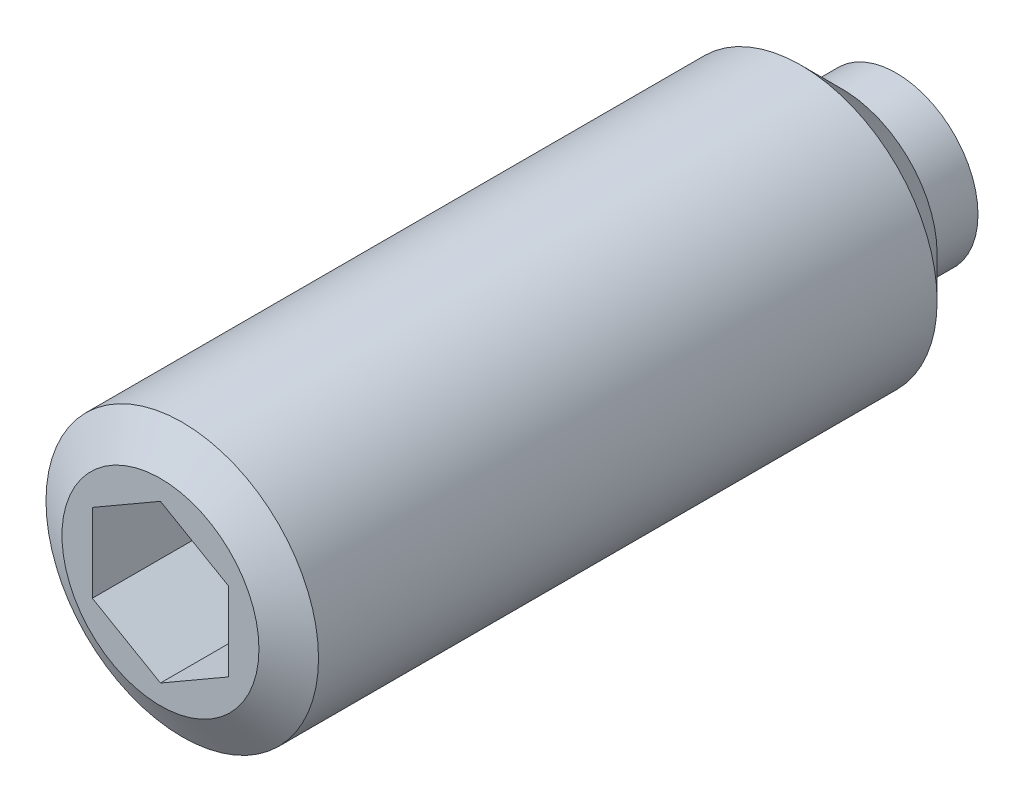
ISO-10303-21;
HEADER;
FILE_DESCRIPTION(('STEP AP214'),'2;1');
FILE_NAME('part.step','',(''),(''),'','','');
FILE_SCHEMA(('AUTOMOTIVE_DESIGN { 1 0 10303 214 1 1 1 1 }'));
ENDSEC;
DATA;
#1=APPLICATION_CONTEXT('core data for automotive mechanical design processes');
#2=APPLICATION_PROTOCOL_DEFINITION('international standard','automotive_design',2000,#1);
#3=PRODUCT_CONTEXT('',#1,'mechanical');
#4=PRODUCT('Part','Part','',(#3));
#5=PRODUCT_RELATED_PRODUCT_CATEGORY('part','',(#4));
#6=PRODUCT_DEFINITION_FORMATION('','',#4);
#7=PRODUCT_DEFINITION_CONTEXT('part definition',#1,'design');
#8=PRODUCT_DEFINITION('design','',#6,#7);
#9=PRODUCT_DEFINITION_SHAPE('','',#8);
#10=(LENGTH_UNIT() NAMED_UNIT(*) SI_UNIT(.MILLI.,.METRE.));
#11=(NAMED_UNIT(*) PLANE_ANGLE_UNIT() SI_UNIT($,.RADIAN.));
#12=(NAMED_UNIT(*) SI_UNIT($,.STERADIAN.) SOLID_ANGLE_UNIT());
#13=UNCERTAINTY_MEASURE_WITH_UNIT(LENGTH_MEASURE(1.E-05),#10,'distance_accuracy_value','');
#14=(GEOMETRIC_REPRESENTATION_CONTEXT(3) GLOBAL_UNCERTAINTY_ASSIGNED_CONTEXT((#13)) GLOBAL_UNIT_ASSIGNED_CONTEXT((#10,
#11,#12)) REPRESENTATION_CONTEXT('',''));
#15=CARTESIAN_POINT('',(0.,0.,0.));
#16=DIRECTION('',(0.,0.,1.));
#17=DIRECTION('',(1.,0.,0.));
#18=AXIS2_PLACEMENT_3D('',#15,#16,#17);
#19=CARTESIAN_POINT('',(3.,0.,0.));
#20=DIRECTION('',(0.,0.,-1.));
#21=DIRECTION('',(-1.,0.,0.));
#22=AXIS2_PLACEMENT_3D('',#19,#20,#21);
#23=PLANE('',#22);
#24=CARTESIAN_POINT('',(0.,0.,0.));
#25=DIRECTION('',(0.,0.,1.));
#26=DIRECTION('',(1.,0.,0.));
#27=AXIS2_PLACEMENT_3D('',#24,#25,#26);
#28=CIRCLE('',#27,3.);
#29=CARTESIAN_POINT('',(3.,0.,0.));
#30=VERTEX_POINT('',#29);
#31=EDGE_CURVE('E124',#30,#30,#28,.T.);
#32=ORIENTED_EDGE('',*,*,#31,.F.);
#33=EDGE_LOOP('',(#32));
#34=FACE_BOUND('',#33,.T.);
#35=ADVANCED_FACE('F14',(#34),#23,.T.);
#36=CARTESIAN_POINT('',(0.,0.,47.));
#37=DIRECTION('',(0.,0.,1.));
#38=DIRECTION('',(1.,0.,0.));
#39=AXIS2_PLACEMENT_3D('',#36,#37,#38);
#40=CYLINDRICAL_SURFACE('',#39,3.);
#41=CARTESIAN_POINT('',(0.,0.,2.));
#42=DIRECTION('',(0.,0.,1.));
#43=DIRECTION('',(1.,0.,0.));
#44=AXIS2_PLACEMENT_3D('',#41,#42,#43);
#45=CIRCLE('',#44,3.);
#46=CARTESIAN_POINT('',(3.,0.,2.));
#47=VERTEX_POINT('',#46);
#48=EDGE_CURVE('E121',#47,#47,#45,.T.);
#49=ORIENTED_EDGE('',*,*,#48,.F.);
#50=EDGE_LOOP('',(#49));
#51=FACE_BOUND('',#50,.T.);
#52=ORIENTED_EDGE('',*,*,#31,.T.);
#53=EDGE_LOOP('',(#52));
#54=FACE_BOUND('',#53,.T.);
#55=ADVANCED_FACE('F149',(#51,#54),#40,.T.);
#56=CARTESIAN_POINT('',(5.,0.,2.));
#57=DIRECTION('',(0.,0.,-1.));
#58=DIRECTION('',(-1.,0.,0.));
#59=AXIS2_PLACEMENT_3D('',#56,#57,#58);
#60=PLANE('',#59);
#61=CARTESIAN_POINT('',(0.,0.,2.));
#62=DIRECTION('',(0.,0.,-1.));
#63=DIRECTION('',(-1.,0.,0.));
#64=AXIS2_PLACEMENT_3D('',#61,#62,#63);
#65=CIRCLE('',#64,3.5);
#66=CARTESIAN_POINT('',(-3.5,0.,2.));
#67=VERTEX_POINT('',#66);
#68=EDGE_CURVE('E130',#67,#67,#65,.T.);
#69=ORIENTED_EDGE('',*,*,#68,.T.);
#70=EDGE_LOOP('',(#69));
#71=FACE_BOUND('',#70,.T.);
#72=ORIENTED_EDGE('',*,*,#48,.T.);
#73=EDGE_LOOP('',(#72));
#74=FACE_BOUND('',#73,.T.);
#75=ADVANCED_FACE('F155',(#71,#74),#60,.T.);
#76=CARTESIAN_POINT('',(0.,0.,47.));
#77=DIRECTION('',(0.,0.,1.));
#78=DIRECTION('',(1.,0.,0.));
#79=AXIS2_PLACEMENT_3D('',#76,#77,#78);
#80=CYLINDRICAL_SURFACE('',#79,5.);
#81=CARTESIAN_POINT('',(0.,0.,26.2));
#82=DIRECTION('',(0.,0.,1.));
#83=DIRECTION('',(1.,0.,0.));
#84=AXIS2_PLACEMENT_3D('',#81,#82,#83);
#85=CIRCLE('',#84,5.);
#86=CARTESIAN_POINT('',(5.,0.,26.2));
#87=VERTEX_POINT('',#86);
#88=EDGE_CURVE('E9',#87,#87,#85,.F.);
#89=ORIENTED_EDGE('',*,*,#88,.T.);
#90=EDGE_LOOP('',(#89));
#91=FACE_BOUND('',#90,.T.);
#92=CARTESIAN_POINT('',(0.,0.,3.5));
#93=DIRECTION('',(0.,0.,-1.));
#94=DIRECTION('',(-1.,0.,0.));
#95=AXIS2_PLACEMENT_3D('',#92,#93,#94);
#96=CIRCLE('',#95,5.);
#97=CARTESIAN_POINT('',(-5.,0.,3.5));
#98=VERTEX_POINT('',#97);
#99=EDGE_CURVE('E127',#98,#98,#96,.F.);
#100=ORIENTED_EDGE('',*,*,#99,.T.);
#101=EDGE_LOOP('',(#100));
#102=FACE_BOUND('',#101,.T.);
#103=ADVANCED_FACE('F162',(#91,#102),#80,.T.);
#104=CARTESIAN_POINT('',(0.,0.,27.));
#105=DIRECTION('',(0.,0.,1.));
#106=DIRECTION('',(1.,0.,0.));
#107=AXIS2_PLACEMENT_3D('',#104,#105,#106);
#108=PLANE('',#107);
#109=CARTESIAN_POINT('',(0.,0.,27.));
#110=DIRECTION('',(0.,0.,1.));
#111=DIRECTION('',(1.,0.,0.));
#112=AXIS2_PLACEMENT_3D('',#109,#110,#111);
#113=CIRCLE('',#112,3.6143593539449);
#114=CARTESIAN_POINT('',(3.6143593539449,0.,27.));
#115=VERTEX_POINT('',#114);
#116=EDGE_CURVE('E22',#115,#115,#113,.T.);
#117=ORIENTED_EDGE('',*,*,#116,.T.);
#118=EDGE_LOOP('',(#117));
#119=FACE_BOUND('',#118,.T.);
#120=DIRECTION('',(0.86602540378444,-0.5,0.));
#121=VECTOR('',#120,1.);
#122=CARTESIAN_POINT('',(-2.5,-1.44337567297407,27.));
#123=LINE('',#122,#121);
#124=CARTESIAN_POINT('',(-2.5,-1.44337567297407,27.));
#125=VERTEX_POINT('',#124);
#126=CARTESIAN_POINT('',(0.,-2.88675134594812,27.));
#127=VERTEX_POINT('',#126);
#128=EDGE_CURVE('E29',#125,#127,#123,.T.);
#129=ORIENTED_EDGE('',*,*,#128,.F.);
#130=DIRECTION('',(0.,-1.,0.));
#131=VECTOR('',#130,1.);
#132=CARTESIAN_POINT('',(-2.5,1.44337567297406,27.));
#133=LINE('',#132,#131);
#134=CARTESIAN_POINT('',(-2.5,1.44337567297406,27.));
#135=VERTEX_POINT('',#134);
#136=EDGE_CURVE('E97',#135,#125,#133,.T.);
#137=ORIENTED_EDGE('',*,*,#136,.F.);
#138=DIRECTION('',(0.866025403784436,0.5,0.));
#139=VECTOR('',#138,1.);
#140=CARTESIAN_POINT('',(-2.5,1.44337567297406,27.));
#141=LINE('',#140,#139);
#142=CARTESIAN_POINT('',(0.,2.88675134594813,27.));
#143=VERTEX_POINT('',#142);
#144=EDGE_CURVE('E92',#135,#143,#141,.T.);
#145=ORIENTED_EDGE('',*,*,#144,.T.);
#146=DIRECTION('',(-0.866025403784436,0.5,0.));
#147=VECTOR('',#146,1.);
#148=CARTESIAN_POINT('',(2.5,1.44337567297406,27.));
#149=LINE('',#148,#147);
#150=CARTESIAN_POINT('',(2.5,1.44337567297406,27.));
#151=VERTEX_POINT('',#150);
#152=EDGE_CURVE('E90',#151,#143,#149,.T.);
#153=ORIENTED_EDGE('',*,*,#152,.F.);
#154=DIRECTION('',(0.,-1.,0.));
#155=VECTOR('',#154,1.);
#156=CARTESIAN_POINT('',(2.5,1.44337567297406,27.));
#157=LINE('',#156,#155);
#158=CARTESIAN_POINT('',(2.5,-1.44337567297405,27.));
#159=VERTEX_POINT('',#158);
#160=EDGE_CURVE('E72',#151,#159,#157,.T.);
#161=ORIENTED_EDGE('',*,*,#160,.T.);
#162=DIRECTION('',(-0.866025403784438,-0.5,0.));
#163=VECTOR('',#162,1.);
#164=CARTESIAN_POINT('',(2.5,-1.44337567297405,27.));
#165=LINE('',#164,#163);
#166=EDGE_CURVE('E83',#159,#127,#165,.T.);
#167=ORIENTED_EDGE('',*,*,#166,.T.);
#168=EDGE_LOOP('',(#129,#137,#145,#153,#161,#167));
#169=FACE_BOUND('',#168,.T.);
#170=ADVANCED_FACE('F87',(#119,#169),#108,.T.);
#171=CARTESIAN_POINT('',(-2.5,-1.44337567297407,23.));
#172=DIRECTION('',(-0.5,-0.86602540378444,0.));
#173=DIRECTION('',(-0.86602540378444,0.5,0.));
#174=AXIS2_PLACEMENT_3D('',#171,#172,#173);
#175=PLANE('',#174);
#176=DIRECTION('',(0.,0.,1.));
#177=VECTOR('',#176,1.);
#178=CARTESIAN_POINT('',(-2.5,-1.44337567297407,23.));
#179=LINE('',#178,#177);
#180=CARTESIAN_POINT('',(-2.5,-1.44337567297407,23.));
#181=VERTEX_POINT('',#180);
#182=EDGE_CURVE('E36',#181,#125,#179,.T.);
#183=ORIENTED_EDGE('',*,*,#182,.T.);
#184=ORIENTED_EDGE('',*,*,#128,.T.);
#185=DIRECTION('',(0.,0.,1.));
#186=VECTOR('',#185,1.);
#187=CARTESIAN_POINT('',(0.,-2.88675134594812,23.));
#188=LINE('',#187,#186);
#189=CARTESIAN_POINT('',(0.,-2.88675134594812,23.));
#190=VERTEX_POINT('',#189);
#191=EDGE_CURVE('E80',#190,#127,#188,.T.);
#192=ORIENTED_EDGE('',*,*,#191,.F.);
#193=DIRECTION('',(0.86602540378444,-0.5,0.));
#194=VECTOR('',#193,1.);
#195=CARTESIAN_POINT('',(-2.5,-1.44337567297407,23.));
#196=LINE('',#195,#194);
#197=EDGE_CURVE('E99',#181,#190,#196,.T.);
#198=ORIENTED_EDGE('',*,*,#197,.F.);
#199=EDGE_LOOP('',(#183,#184,#192,#198));
#200=FACE_BOUND('',#199,.T.);
#201=ADVANCED_FACE('F169',(#200),#175,.F.);
#202=CARTESIAN_POINT('',(-2.5,1.44337567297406,23.));
#203=DIRECTION('',(-1.,0.,0.));
#204=DIRECTION('',(0.,1.,0.));
#205=AXIS2_PLACEMENT_3D('',#202,#203,#204);
#206=PLANE('',#205);
#207=DIRECTION('',(0.,0.,1.));
#208=VECTOR('',#207,1.);
#209=CARTESIAN_POINT('',(-2.5,1.44337567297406,23.));
#210=LINE('',#209,#208);
#211=CARTESIAN_POINT('',(-2.5,1.44337567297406,23.));
#212=VERTEX_POINT('',#211);
#213=EDGE_CURVE('E118',#212,#135,#210,.T.);
#214=ORIENTED_EDGE('',*,*,#213,.T.);
#215=ORIENTED_EDGE('',*,*,#136,.T.);
#216=ORIENTED_EDGE('',*,*,#182,.F.);
#217=DIRECTION('',(0.,-1.,0.));
#218=VECTOR('',#217,1.);
#219=CARTESIAN_POINT('',(-2.5,1.44337567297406,23.));
#220=LINE('',#219,#218);
#221=EDGE_CURVE('E111',#212,#181,#220,.T.);
#222=ORIENTED_EDGE('',*,*,#221,.F.);
#223=EDGE_LOOP('',(#214,#215,#216,#222));
#224=FACE_BOUND('',#223,.T.);
#225=ADVANCED_FACE('F170',(#224),#206,.F.);
#226=CARTESIAN_POINT('',(-2.5,1.44337567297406,23.));
#227=DIRECTION('',(0.5,-0.866025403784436,0.));
#228=DIRECTION('',(-0.866025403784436,-0.5,0.));
#229=AXIS2_PLACEMENT_3D('',#226,#227,#228);
#230=PLANE('',#229);
#231=DIRECTION('',(0.,0.,1.));
#232=VECTOR('',#231,1.);
#233=CARTESIAN_POINT('',(0.,2.88675134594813,23.));
#234=LINE('',#233,#232);
#235=CARTESIAN_POINT('',(0.,2.88675134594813,23.));
#236=VERTEX_POINT('',#235);
#237=EDGE_CURVE('E116',#236,#143,#234,.T.);
#238=ORIENTED_EDGE('',*,*,#237,.T.);
#239=ORIENTED_EDGE('',*,*,#144,.F.);
#240=ORIENTED_EDGE('',*,*,#213,.F.);
#241=DIRECTION('',(0.866025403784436,0.5,0.));
#242=VECTOR('',#241,1.);
#243=CARTESIAN_POINT('',(-2.5,1.44337567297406,23.));
#244=LINE('',#243,#242);
#245=EDGE_CURVE('E108',#212,#236,#244,.T.);
#246=ORIENTED_EDGE('',*,*,#245,.T.);
#247=EDGE_LOOP('',(#238,#239,#240,#246));
#248=FACE_BOUND('',#247,.T.);
#249=ADVANCED_FACE('F173',(#248),#230,.T.);
#250=CARTESIAN_POINT('',(2.5,1.44337567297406,23.));
#251=DIRECTION('',(0.5,0.866025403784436,0.));
#252=DIRECTION('',(0.866025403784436,-0.5,0.));
#253=AXIS2_PLACEMENT_3D('',#250,#251,#252);
#254=PLANE('',#253);
#255=DIRECTION('',(0.,0.,1.));
#256=VECTOR('',#255,1.);
#257=CARTESIAN_POINT('',(2.5,1.44337567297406,23.));
#258=LINE('',#257,#256);
#259=CARTESIAN_POINT('',(2.5,1.44337567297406,23.));
#260=VERTEX_POINT('',#259);
#261=EDGE_CURVE('E79',#260,#151,#258,.T.);
#262=ORIENTED_EDGE('',*,*,#261,.T.);
#263=ORIENTED_EDGE('',*,*,#152,.T.);
#264=ORIENTED_EDGE('',*,*,#237,.F.);
#265=DIRECTION('',(-0.866025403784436,0.5,0.));
#266=VECTOR('',#265,1.);
#267=CARTESIAN_POINT('',(2.5,1.44337567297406,23.));
#268=LINE('',#267,#266);
#269=EDGE_CURVE('E105',#260,#236,#268,.T.);
#270=ORIENTED_EDGE('',*,*,#269,.F.);
#271=EDGE_LOOP('',(#262,#263,#264,#270));
#272=FACE_BOUND('',#271,.T.);
#273=ADVANCED_FACE('F176',(#272),#254,.F.);
#274=CARTESIAN_POINT('',(2.5,1.44337567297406,23.));
#275=DIRECTION('',(-1.,0.,0.));
#276=DIRECTION('',(0.,1.,0.));
#277=AXIS2_PLACEMENT_3D('',#274,#275,#276);
#278=PLANE('',#277);
#279=DIRECTION('',(0.,0.,1.));
#280=VECTOR('',#279,1.);
#281=CARTESIAN_POINT('',(2.5,-1.44337567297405,23.));
#282=LINE('',#281,#280);
#283=CARTESIAN_POINT('',(2.5,-1.44337567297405,23.));
#284=VERTEX_POINT('',#283);
#285=EDGE_CURVE('E68',#284,#159,#282,.T.);
#286=ORIENTED_EDGE('',*,*,#285,.T.);
#287=ORIENTED_EDGE('',*,*,#160,.F.);
#288=ORIENTED_EDGE('',*,*,#261,.F.);
#289=DIRECTION('',(0.,-1.,0.));
#290=VECTOR('',#289,1.);
#291=CARTESIAN_POINT('',(2.5,1.44337567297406,23.));
#292=LINE('',#291,#290);
#293=EDGE_CURVE('E75',#260,#284,#292,.T.);
#294=ORIENTED_EDGE('',*,*,#293,.T.);
#295=EDGE_LOOP('',(#286,#287,#288,#294));
#296=FACE_BOUND('',#295,.T.);
#297=ADVANCED_FACE('F70',(#296),#278,.T.);
#298=CARTESIAN_POINT('',(2.5,-1.44337567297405,23.));
#299=DIRECTION('',(-0.5,0.866025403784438,0.));
#300=DIRECTION('',(0.866025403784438,0.5,0.));
#301=AXIS2_PLACEMENT_3D('',#298,#299,#300);
#302=PLANE('',#301);
#303=DIRECTION('',(-0.866025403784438,-0.5,0.));
#304=VECTOR('',#303,1.);
#305=CARTESIAN_POINT('',(2.5,-1.44337567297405,23.));
#306=LINE('',#305,#304);
#307=EDGE_CURVE('E102',#284,#190,#306,.T.);
#308=ORIENTED_EDGE('',*,*,#307,.T.);
#309=ORIENTED_EDGE('',*,*,#191,.T.);
#310=ORIENTED_EDGE('',*,*,#166,.F.);
#311=ORIENTED_EDGE('',*,*,#285,.F.);
#312=EDGE_LOOP('',(#308,#309,#310,#311));
#313=FACE_BOUND('',#312,.T.);
#314=ADVANCED_FACE('F84',(#313),#302,.T.);
#315=CARTESIAN_POINT('',(2.5,-4.33012701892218,23.));
#316=DIRECTION('',(0.,0.,-1.));
#317=DIRECTION('',(-1.,0.,0.));
#318=AXIS2_PLACEMENT_3D('',#315,#316,#317);
#319=PLANE('',#318);
#320=ORIENTED_EDGE('',*,*,#197,.T.);
#321=ORIENTED_EDGE('',*,*,#307,.F.);
#322=ORIENTED_EDGE('',*,*,#293,.F.);
#323=ORIENTED_EDGE('',*,*,#269,.T.);
#324=ORIENTED_EDGE('',*,*,#245,.F.);
#325=ORIENTED_EDGE('',*,*,#221,.T.);
#326=EDGE_LOOP('',(#320,#321,#322,#323,#324,#325));
#327=FACE_BOUND('',#326,.T.);
#328=ADVANCED_FACE('F144',(#327),#319,.F.);
#329=CARTESIAN_POINT('',(0.,0.,3.5));
#330=DIRECTION('',(0.,0.,1.));
#331=DIRECTION('',(1.,0.,0.));
#332=AXIS2_PLACEMENT_3D('',#329,#330,#331);
#333=CONICAL_SURFACE('',#332,5.,0.785398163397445);
#334=ORIENTED_EDGE('',*,*,#68,.F.);
#335=EDGE_LOOP('',(#334));
#336=FACE_BOUND('',#335,.T.);
#337=ORIENTED_EDGE('',*,*,#99,.F.);
#338=EDGE_LOOP('',(#337));
#339=FACE_BOUND('',#338,.T.);
#340=ADVANCED_FACE('F137',(#336,#339),#333,.T.);
#341=CARTESIAN_POINT('',(0.,0.,27.));
#342=DIRECTION('',(0.,0.,-1.));
#343=DIRECTION('',(-1.,0.,0.));
#344=AXIS2_PLACEMENT_3D('',#341,#342,#343);
#345=CONICAL_SURFACE('',#344,3.6143593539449,1.0471975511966);
#346=ORIENTED_EDGE('',*,*,#88,.F.);
#347=EDGE_LOOP('',(#346));
#348=FACE_BOUND('',#347,.T.);
#349=ORIENTED_EDGE('',*,*,#116,.F.);
#350=EDGE_LOOP('',(#349));
#351=FACE_BOUND('',#350,.T.);
#352=ADVANCED_FACE('F16',(#348,#351),#345,.T.);
#353=CLOSED_SHELL('',(#35,#55,#75,#103,#170,#201,#225,#249,#273,#297,#314,#328,#340,#352));
#354=MANIFOLD_SOLID_BREP('B1',#353);
#355=ADVANCED_BREP_SHAPE_REPRESENTATION('',(#18,#354),#14);
#356=SHAPE_DEFINITION_REPRESENTATION(#9,#355);
ENDSEC;
END-ISO-10303-21;
